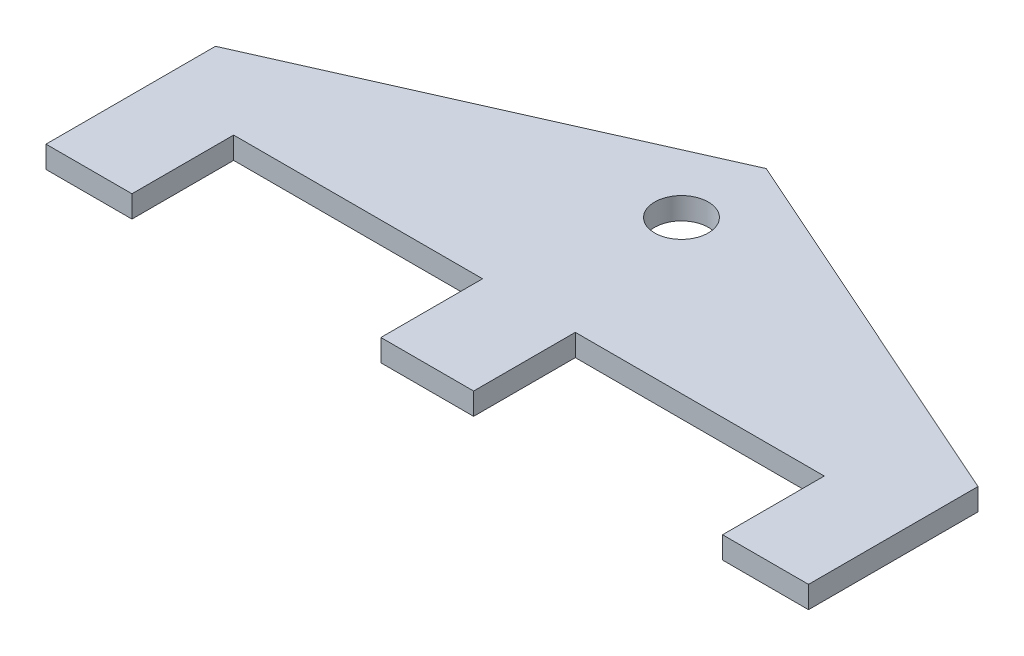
from build123d import *

# Parameters (mm, degrees)
SKETCH1_R           = 2.5146
BOSS_EXTRUDE1_DEPTH = 2.0574
SKETCH2_W           = 23.3172
SKETCH2_H           = 9.525
CUT_EXTRUDE1_DEPTH  = 2.0574


with BuildPart() as part:
    # Sketch1 → Boss-Extrude1 (new body)
    with BuildSketch(Plane(origin=(0, 0, 0), x_dir=(1, 0, 0), z_dir=(0, 1, 0))):
        Polygon((-35.7124, -23.8125), (35.7124, -23.8125), (35.7124, -7.9375), (0, 7.9375), (-35.7124, -7.9375), align=None)
        with Locations(Location((0, 0, 0), (0, 0, 270))):
            Circle(SKETCH1_R, mode=Mode.SUBTRACT)
    extrude(amount=BOSS_EXTRUDE1_DEPTH)

    # Sketch2 → Cut-Extrude1 (cut)
    with BuildSketch(Plane(origin=(0, 2.0574, 0), x_dir=(1, 0, 0), z_dir=(0, 1, 0))):
        with Locations((-16.002, -19.05)):
            Rectangle(SKETCH2_W, SKETCH2_H)
        with Locations((16.002, -19.05)):
            Rectangle(SKETCH2_W, SKETCH2_H)
    extrude(amount=-CUT_EXTRUDE1_DEPTH, mode=Mode.SUBTRACT)


solid = part.part
